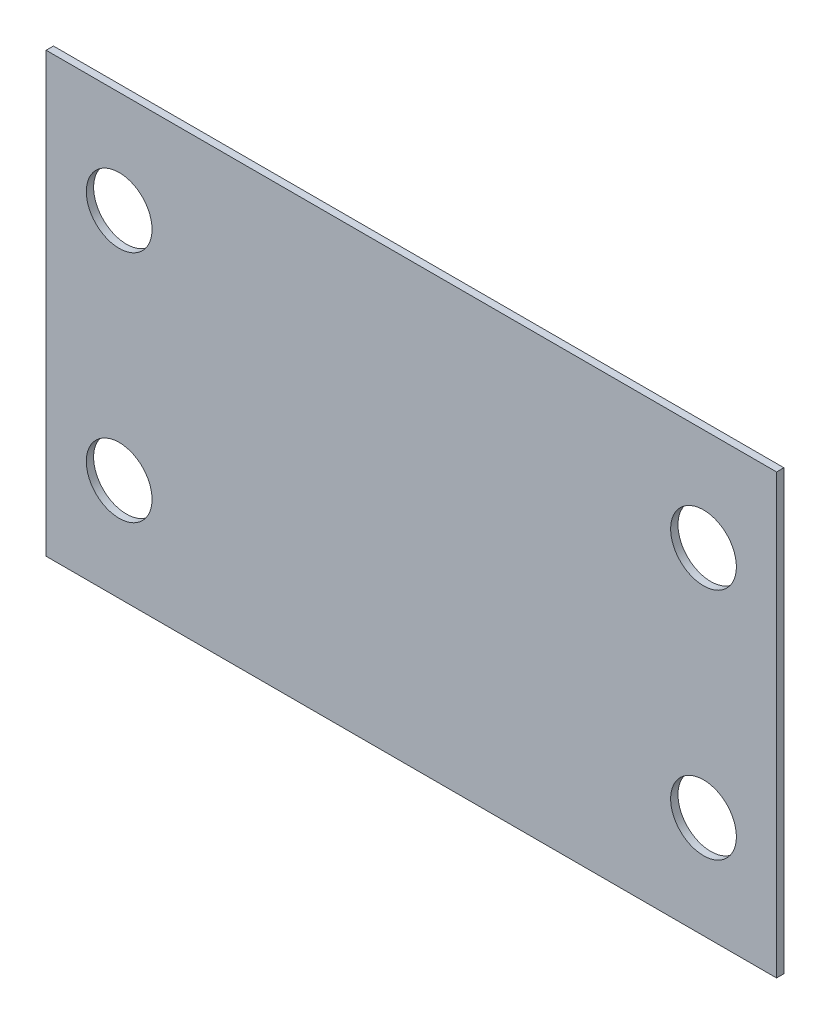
from build123d import *

# Parameters (mm, degrees)
ESQUISSE1_W        = 50
ESQUISSE1_H        = 30
ESQUISSE1_R        = 2.25
BOSS_EXTRU_1_DEPTH = 0.5


with BuildPart() as part:
    # Esquisse1 → Boss.-Extru.1 (new body)
    with BuildSketch(Plane.XY):
        Rectangle(ESQUISSE1_W, ESQUISSE1_H)
        with Locations((20, -8)):
            Circle(ESQUISSE1_R, mode=Mode.SUBTRACT)
        with Locations((20, 8)):
            Circle(ESQUISSE1_R, mode=Mode.SUBTRACT)
        with Locations((-20, -8)):
            Circle(ESQUISSE1_R, mode=Mode.SUBTRACT)
        with Locations((-20, 8)):
            Circle(ESQUISSE1_R, mode=Mode.SUBTRACT)
    extrude(amount=BOSS_EXTRU_1_DEPTH)


solid = part.part
